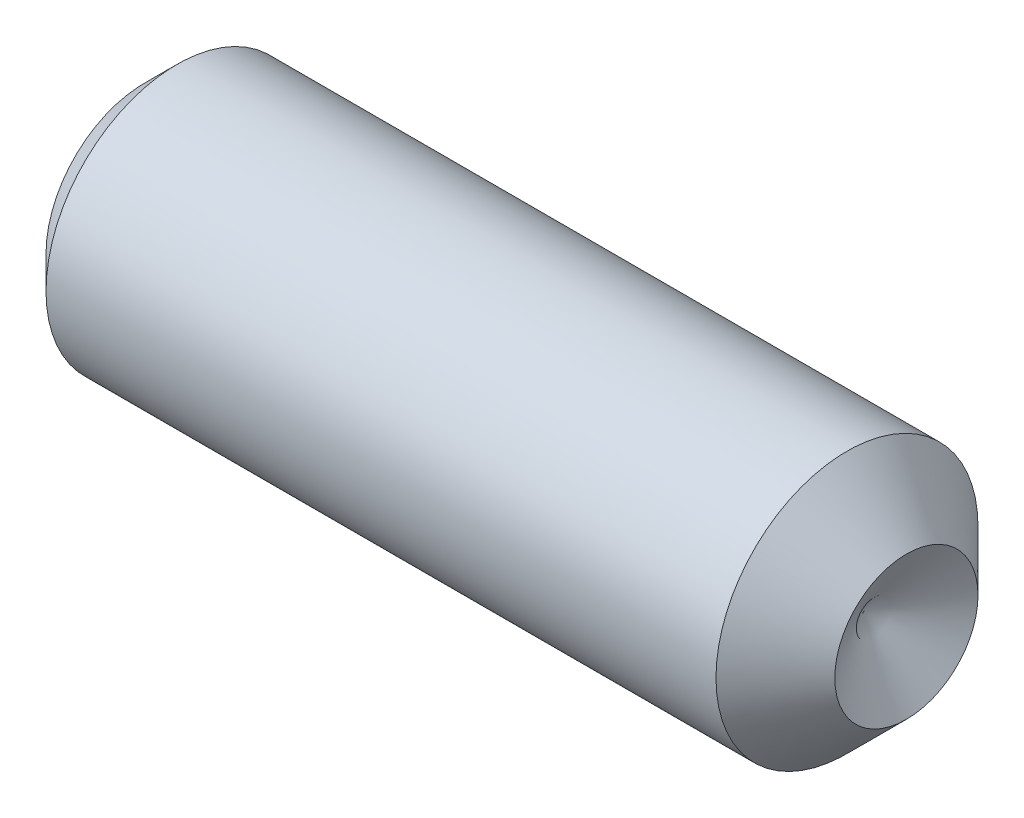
from build123d import *

# Parameters (mm, degrees)
HEX_2_DEPTH = 1.524


with BuildPart() as part:
    # BodySke → BaseBody (revolve)
    with BuildSketch(Plane.XY, mode=Mode.PRIVATE) as basebody_sk:
        Polygon((0, 0), (0, 0.82296), (0.26924, 1.0922), (5.8547, 1.0922), (6.35, 0.5969), (5.991346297, 0), align=None)
    revolve(basebody_sk.sketch.rotate(Axis((-12.7, 0, 0), (1, 0, 0)), 90), axis=Axis((-12.7, 0, 0), (1, 0, 0)))

    # Sketch2 → Hex 2 (cut)
    with BuildSketch(Plane.ZY):
        Polygon((0.256632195, 0.4445), (-0.256632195, 0.4445), (-0.513264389, 0), (-0.256632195, -0.4445), (0.256632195, -0.4445), (0.513264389, 0), align=None)
    extrude(amount=-HEX_2_DEPTH, mode=Mode.SUBTRACT)


solid = part.part
